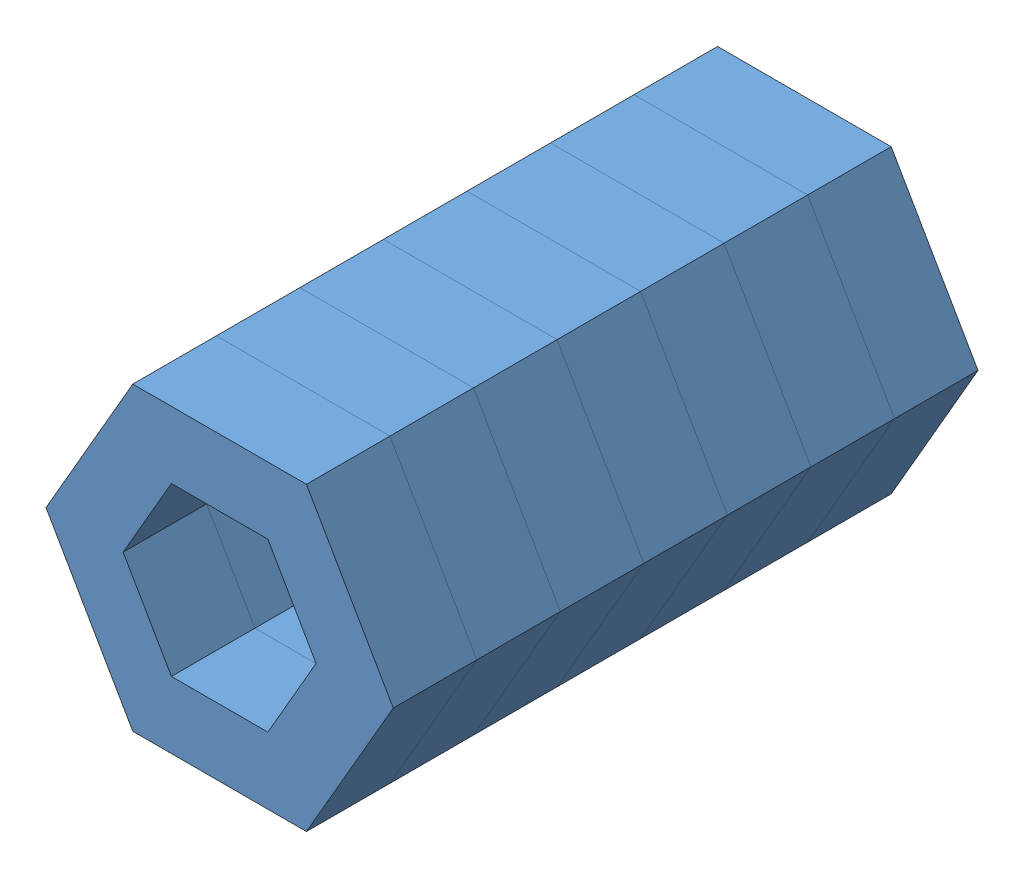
SolidWorks assembly Spacer-stack-7.SLDASM, configuration Default (file format 7000). Lengths in mm.
Overall size (13.2 11.43 22.23).
7 component instances, 1 part files, 12 mates.
Components (placement in the parent):
- Spacer-hex-1s4-1: Spacer-hex-1s4.SLDPRT [Default] at (7.8847 8.4687 7.4956) size (13.2 11.43 3.17)
- Spacer-hex-1s4-2: Spacer-hex-1s4.SLDPRT [Default] at (7.8847 8.4687 10.6706) size (13.2 11.43 3.17)
- Spacer-hex-1s4-3: Spacer-hex-1s4.SLDPRT [Default] at (7.8847 8.4687 13.8456) size (13.2 11.43 3.17)
- Spacer-hex-1s4-4: Spacer-hex-1s4.SLDPRT [Default] at (7.8847 8.4687 17.0206) size (13.2 11.43 3.17)
- Spacer-hex-1s4-5: Spacer-hex-1s4.SLDPRT [Default] at (7.8847 8.4687 20.1956) size (13.2 11.43 3.17)
- Spacer-hex-1s4-6: Spacer-hex-1s4.SLDPRT [Default] at (7.8847 8.4687 23.3706) size (13.2 11.43 3.17)
- Spacer-hex-1s4-7: Spacer-hex-1s4.SLDPRT [Default] at (7.8847 8.4687 26.5456) size (13.2 11.43 3.17)
Mates (geometry in assembly coordinates):
- Coincident3: coincident aligned: line of Spacer-hex-1s4-1 through (9.7178 11.6437 10.6706) axis (-1 0 0); line of Spacer-hex-1s4-2 through (9.7178 11.6437 10.6706) axis (-1 0 0)
- Coincident4: coincident aligned: line of Spacer-hex-1s4-1 through (11.5509 8.4687 10.6706) axis (-0.5 0.866025 0); line of Spacer-hex-1s4-2 through (11.5509 8.4687 10.6706) axis (-0.5 0.866025 0)
- Coincident5: coincident aligned: line of Spacer-hex-1s4-2 through (9.7178 11.6437 13.8456) axis (-1 0 0); line of Spacer-hex-1s4-3 through (9.7178 11.6437 13.8456) axis (-1 0 0)
- Coincident6: coincident aligned: line of Spacer-hex-1s4-2 through (11.5509 8.4687 13.8456) axis (-0.5 0.866025 0); line of Spacer-hex-1s4-3 through (11.5509 8.4687 13.8456) axis (-0.5 0.866025 0)
- Coincident9: coincident aligned: line of Spacer-hex-1s4-3 through (11.5509 8.4687 17.0206) axis (-0.5 0.866025 0); line of Spacer-hex-1s4-4 through (11.5509 8.4687 17.0206) axis (-0.5 0.866025 0)
- Coincident10: coincident aligned: line of Spacer-hex-1s4-3 through (9.7178 11.6437 17.0206) axis (-1 0 0); line of Spacer-hex-1s4-4 through (9.7178 11.6437 17.0206) axis (-1 0 0)
- Coincident11: coincident aligned: line of Spacer-hex-1s4-4 through (9.7178 11.6437 20.1956) axis (-1 0 0); line of Spacer-hex-1s4-5 through (9.7178 11.6437 20.1956) axis (-1 0 0)
- Coincident12: coincident aligned: line of Spacer-hex-1s4-4 through (11.5509 8.4687 20.1956) axis (-0.5 0.866025 0); line of Spacer-hex-1s4-5 through (11.5509 8.4687 20.1956) axis (-0.5 0.866025 0)
- Coincident13: coincident aligned: line of Spacer-hex-1s4-5 through (9.7178 11.6437 23.3706) axis (-1 0 0); line of Spacer-hex-1s4-6 through (9.7178 11.6437 23.3706) axis (-1 0 0)
- Coincident14: coincident aligned: line of Spacer-hex-1s4-5 through (11.5509 8.4687 23.3706) axis (-0.5 0.866025 0); line of Spacer-hex-1s4-6 through (11.5509 8.4687 23.3706) axis (-0.5 0.866025 0)
- Coincident15: coincident aligned: line of Spacer-hex-1s4-6 through (9.7178 11.6437 26.5456) axis (-1 0 0); line of Spacer-hex-1s4-7 through (9.7178 11.6437 26.5456) axis (-1 0 0)
- Coincident16: coincident aligned: line of Spacer-hex-1s4-6 through (11.5509 8.4687 26.5456) axis (-0.5 0.866025 0); line of Spacer-hex-1s4-7 through (11.5509 8.4687 26.5456) axis (-0.5 0.866025 0)
